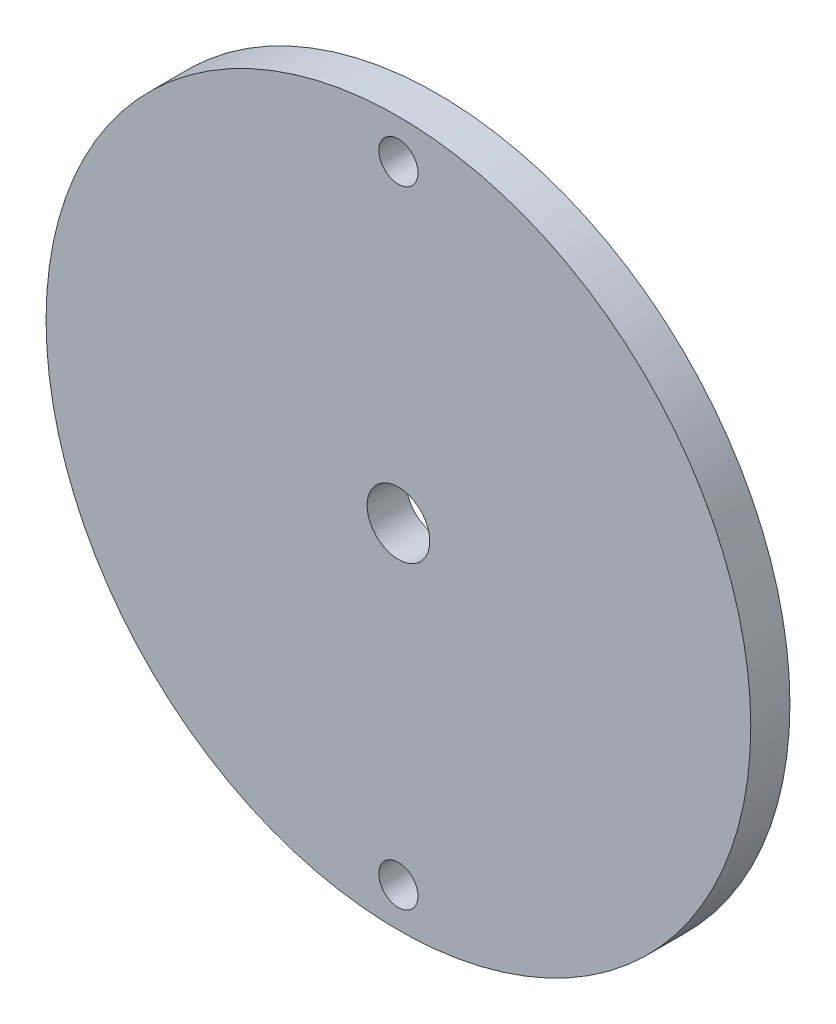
from build123d import *

# Parameters (mm, degrees)
SKETCH_1_R          = 4
EXTRUDE_1_DEPTH     = 70
SKETCH_2_R          = 75
EXTRUDE_2_DEPTH     = 5
EXTRUDE_START       = -30
SKETCH_5_R          = 45
EXTRUDE_3_DEPTH     = 5
SKETCH_6_R          = 2.5
CUT_EXTRUDE_1_DEPTH = 100
SKETCH_15_R         = 153.230188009
CUT_EXTRUDE_7_DEPTH = 35
SKETCH_16_R         = 4
CUT_EXTRUDE_8_DEPTH = 88


with BuildPart() as part:
    # Sketch 1 → Extrude 1 (new body)
    with BuildSketch(Plane.XY):
        Circle(SKETCH_1_R)
    extrude(amount=EXTRUDE_1_DEPTH)

    # Sketch 2 → Extrude 2 (add)
    with BuildSketch(Plane.XY.offset(70)):
        Circle(SKETCH_2_R)
    extrude(amount=-EXTRUDE_2_DEPTH)

    # Sketch 5 → Extrude 3 (add)
    with BuildSketch(Plane(origin=(0, 0, 0), x_dir=(-1, 0, 0), z_dir=(0, 0, -1)).offset(EXTRUDE_START)):
        Circle(SKETCH_5_R)
    extrude(amount=-EXTRUDE_3_DEPTH)

    # Sketch 6 → Cut-Extrude 1 (cut)
    with BuildSketch(Plane(origin=(0, 0, 30), x_dir=(-1, 0, 0), z_dir=(0, 0, -1))):
        with Locations((0, 40)):
            Circle(SKETCH_6_R)
    cut_extrude_1 = extrude(amount=-CUT_EXTRUDE_1_DEPTH, mode=Mode.SUBTRACT)

    # Mirror 1: Cut-Extrude 1 across plane
    add(cut_extrude_1.mirror(Plane.ZX), mode=Mode.SUBTRACT)

    # Sketch 15 → Cut-Extrude 7 (cut)
    with BuildSketch(Plane.XY.offset(70)):
        Circle(SKETCH_15_R)
    extrude(amount=-CUT_EXTRUDE_7_DEPTH, mode=Mode.SUBTRACT)

    # Sketch 16 → Cut-Extrude 8 (cut)
    with BuildSketch(Plane(origin=(0, 0, 0), x_dir=(-1, 0, 0), z_dir=(0, 0, -1))):
        Circle(SKETCH_16_R)
    extrude(amount=-CUT_EXTRUDE_8_DEPTH, mode=Mode.SUBTRACT)


solid = part.part
